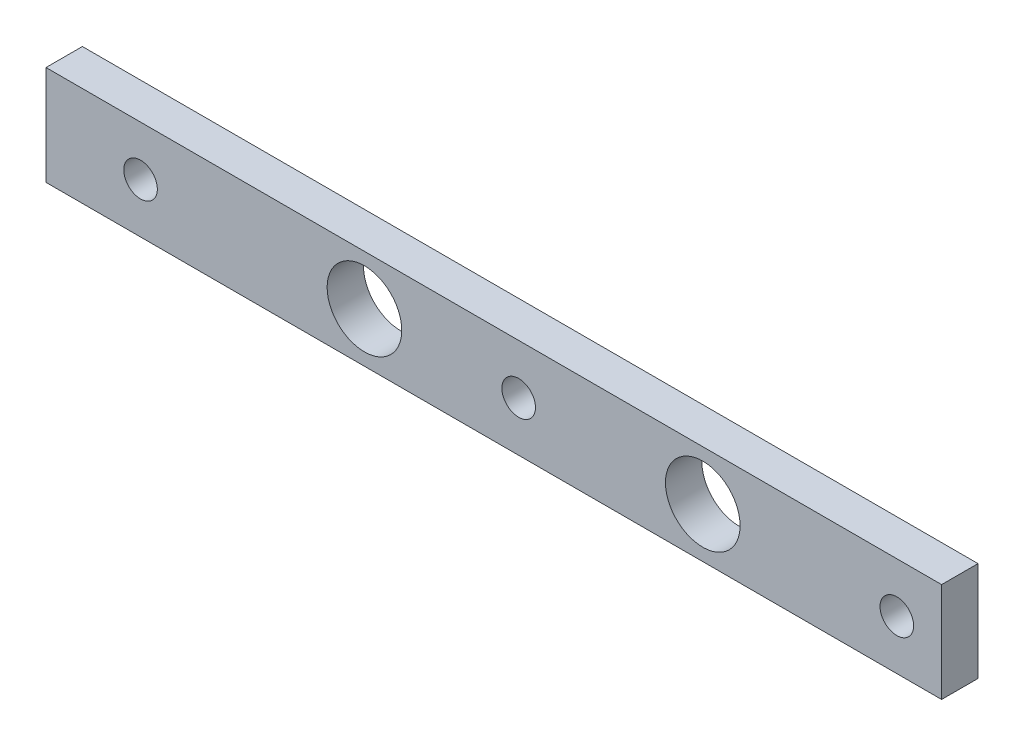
ISO-10303-21;
HEADER;
FILE_DESCRIPTION(('STEP AP214'),'2;1');
FILE_NAME('part.step','',(''),(''),'','','');
FILE_SCHEMA(('AUTOMOTIVE_DESIGN { 1 0 10303 214 1 1 1 1 }'));
ENDSEC;
DATA;
#1=APPLICATION_CONTEXT('core data for automotive mechanical design processes');
#2=APPLICATION_PROTOCOL_DEFINITION('international standard','automotive_design',2000,#1);
#3=PRODUCT_CONTEXT('',#1,'mechanical');
#4=PRODUCT('Part','Part','',(#3));
#5=PRODUCT_RELATED_PRODUCT_CATEGORY('part','',(#4));
#6=PRODUCT_DEFINITION_FORMATION('','',#4);
#7=PRODUCT_DEFINITION_CONTEXT('part definition',#1,'design');
#8=PRODUCT_DEFINITION('design','',#6,#7);
#9=PRODUCT_DEFINITION_SHAPE('','',#8);
#10=(LENGTH_UNIT() NAMED_UNIT(*) SI_UNIT(.MILLI.,.METRE.));
#11=(NAMED_UNIT(*) PLANE_ANGLE_UNIT() SI_UNIT($,.RADIAN.));
#12=(NAMED_UNIT(*) SI_UNIT($,.STERADIAN.) SOLID_ANGLE_UNIT());
#13=UNCERTAINTY_MEASURE_WITH_UNIT(LENGTH_MEASURE(1.E-05),#10,'distance_accuracy_value','');
#14=(GEOMETRIC_REPRESENTATION_CONTEXT(3) GLOBAL_UNCERTAINTY_ASSIGNED_CONTEXT((#13)) GLOBAL_UNIT_ASSIGNED_CONTEXT((#10,
#11,#12)) REPRESENTATION_CONTEXT('',''));
#15=CARTESIAN_POINT('',(0.,0.,0.));
#16=DIRECTION('',(0.,0.,1.));
#17=DIRECTION('',(1.,0.,0.));
#18=AXIS2_PLACEMENT_3D('',#15,#16,#17);
#19=CARTESIAN_POINT('',(-741.045,57.15,11.6082064));
#20=DIRECTION('',(1.,0.,0.));
#21=DIRECTION('',(0.,0.,-1.));
#22=AXIS2_PLACEMENT_3D('',#19,#20,#21);
#23=PLANE('',#22);
#24=DIRECTION('',(0.,-1.,0.));
#25=VECTOR('',#24,1.);
#26=CARTESIAN_POINT('',(-741.045,57.15,0.));
#27=LINE('',#26,#25);
#28=CARTESIAN_POINT('',(-741.045,57.15,0.));
#29=VERTEX_POINT('',#28);
#30=CARTESIAN_POINT('',(-741.045,25.4,0.));
#31=VERTEX_POINT('',#30);
#32=EDGE_CURVE('E112',#29,#31,#27,.T.);
#33=ORIENTED_EDGE('',*,*,#32,.T.);
#34=DIRECTION('',(0.,0.,-1.));
#35=VECTOR('',#34,1.);
#36=CARTESIAN_POINT('',(-741.045,25.4,11.6082064));
#37=LINE('',#36,#35);
#38=CARTESIAN_POINT('',(-741.045,25.4,11.6082064));
#39=VERTEX_POINT('',#38);
#40=EDGE_CURVE('E11',#39,#31,#37,.T.);
#41=ORIENTED_EDGE('',*,*,#40,.F.);
#42=DIRECTION('',(0.,-1.,0.));
#43=VECTOR('',#42,1.);
#44=CARTESIAN_POINT('',(-741.045,57.15,11.6082064));
#45=LINE('',#44,#43);
#46=CARTESIAN_POINT('',(-741.045,57.15,11.6082064));
#47=VERTEX_POINT('',#46);
#48=EDGE_CURVE('E98',#47,#39,#45,.T.);
#49=ORIENTED_EDGE('',*,*,#48,.F.);
#50=DIRECTION('',(0.,0.,-1.));
#51=VECTOR('',#50,1.);
#52=CARTESIAN_POINT('',(-741.045,57.15,11.6082064));
#53=LINE('',#52,#51);
#54=EDGE_CURVE('E108',#47,#29,#53,.T.);
#55=ORIENTED_EDGE('',*,*,#54,.T.);
#56=EDGE_LOOP('',(#33,#41,#49,#55));
#57=FACE_BOUND('',#56,.T.);
#58=ADVANCED_FACE('F47',(#57),#23,.F.);
#59=CARTESIAN_POINT('',(-741.045,25.4,11.6082064));
#60=DIRECTION('',(0.,1.,0.));
#61=DIRECTION('',(0.,0.,1.));
#62=AXIS2_PLACEMENT_3D('',#59,#60,#61);
#63=PLANE('',#62);
#64=DIRECTION('',(1.,0.,0.));
#65=VECTOR('',#64,1.);
#66=CARTESIAN_POINT('',(-741.045,25.4,0.));
#67=LINE('',#66,#65);
#68=CARTESIAN_POINT('',(-455.295,25.4,0.));
#69=VERTEX_POINT('',#68);
#70=EDGE_CURVE('E103',#31,#69,#67,.T.);
#71=ORIENTED_EDGE('',*,*,#70,.T.);
#72=DIRECTION('',(0.,0.,-1.));
#73=VECTOR('',#72,1.);
#74=CARTESIAN_POINT('',(-455.295,25.4,11.6082064));
#75=LINE('',#74,#73);
#76=CARTESIAN_POINT('',(-455.295,25.4,11.6082064));
#77=VERTEX_POINT('',#76);
#78=EDGE_CURVE('E55',#77,#69,#75,.T.);
#79=ORIENTED_EDGE('',*,*,#78,.F.);
#80=DIRECTION('',(1.,0.,0.));
#81=VECTOR('',#80,1.);
#82=CARTESIAN_POINT('',(-741.045,25.4,11.6082064));
#83=LINE('',#82,#81);
#84=EDGE_CURVE('E93',#39,#77,#83,.T.);
#85=ORIENTED_EDGE('',*,*,#84,.F.);
#86=ORIENTED_EDGE('',*,*,#40,.T.);
#87=EDGE_LOOP('',(#71,#79,#85,#86));
#88=FACE_BOUND('',#87,.T.);
#89=ADVANCED_FACE('F102',(#88),#63,.F.);
#90=CARTESIAN_POINT('',(-455.295,57.15,11.6082064));
#91=DIRECTION('',(-1.,0.,0.));
#92=DIRECTION('',(0.,0.,1.));
#93=AXIS2_PLACEMENT_3D('',#90,#91,#92);
#94=PLANE('',#93);
#95=DIRECTION('',(0.,1.,0.));
#96=VECTOR('',#95,1.);
#97=CARTESIAN_POINT('',(-455.295,57.15,0.));
#98=LINE('',#97,#96);
#99=CARTESIAN_POINT('',(-455.295,57.15,0.));
#100=VERTEX_POINT('',#99);
#101=EDGE_CURVE('E80',#69,#100,#98,.T.);
#102=ORIENTED_EDGE('',*,*,#101,.T.);
#103=DIRECTION('',(0.,0.,-1.));
#104=VECTOR('',#103,1.);
#105=CARTESIAN_POINT('',(-455.295,57.15,11.6082064));
#106=LINE('',#105,#104);
#107=CARTESIAN_POINT('',(-455.295,57.15,11.6082064));
#108=VERTEX_POINT('',#107);
#109=EDGE_CURVE('E104',#108,#100,#106,.T.);
#110=ORIENTED_EDGE('',*,*,#109,.F.);
#111=DIRECTION('',(0.,1.,0.));
#112=VECTOR('',#111,1.);
#113=CARTESIAN_POINT('',(-455.295,57.15,11.6082064));
#114=LINE('',#113,#112);
#115=EDGE_CURVE('E96',#77,#108,#114,.T.);
#116=ORIENTED_EDGE('',*,*,#115,.F.);
#117=ORIENTED_EDGE('',*,*,#78,.T.);
#118=EDGE_LOOP('',(#102,#110,#116,#117));
#119=FACE_BOUND('',#118,.T.);
#120=ADVANCED_FACE('F105',(#119),#94,.F.);
#121=CARTESIAN_POINT('',(-741.045,57.15,11.6082064));
#122=DIRECTION('',(0.,-1.,0.));
#123=DIRECTION('',(0.,0.,-1.));
#124=AXIS2_PLACEMENT_3D('',#121,#122,#123);
#125=PLANE('',#124);
#126=DIRECTION('',(-1.,0.,0.));
#127=VECTOR('',#126,1.);
#128=CARTESIAN_POINT('',(-741.045,57.15,0.));
#129=LINE('',#128,#127);
#130=EDGE_CURVE('E86',#100,#29,#129,.T.);
#131=ORIENTED_EDGE('',*,*,#130,.T.);
#132=ORIENTED_EDGE('',*,*,#54,.F.);
#133=DIRECTION('',(-1.,0.,0.));
#134=VECTOR('',#133,1.);
#135=CARTESIAN_POINT('',(-741.045,57.15,11.6082064));
#136=LINE('',#135,#134);
#137=EDGE_CURVE('E63',#108,#47,#136,.T.);
#138=ORIENTED_EDGE('',*,*,#137,.F.);
#139=ORIENTED_EDGE('',*,*,#109,.T.);
#140=EDGE_LOOP('',(#131,#132,#138,#139));
#141=FACE_BOUND('',#140,.T.);
#142=ADVANCED_FACE('F122',(#141),#125,.F.);
#143=CARTESIAN_POINT('',(0.,0.,11.6082064));
#144=DIRECTION('',(0.,0.,1.));
#145=DIRECTION('',(1.,0.,0.));
#146=AXIS2_PLACEMENT_3D('',#143,#144,#145);
#147=PLANE('',#146);
#148=CARTESIAN_POINT('',(-639.445,41.275,11.6082064));
#149=DIRECTION('',(0.,0.,-1.));
#150=DIRECTION('',(-1.,0.,0.));
#151=AXIS2_PLACEMENT_3D('',#148,#149,#150);
#152=CIRCLE('',#151,11.90625);
#153=CARTESIAN_POINT('',(-651.35125,41.275,11.6082064));
#154=VERTEX_POINT('',#153);
#155=EDGE_CURVE('E175',#154,#154,#152,.T.);
#156=ORIENTED_EDGE('',*,*,#155,.T.);
#157=EDGE_LOOP('',(#156));
#158=FACE_BOUND('',#157,.T.);
#159=CARTESIAN_POINT('',(-531.495,41.275,11.6082064));
#160=DIRECTION('',(0.,0.,-1.));
#161=DIRECTION('',(-1.,0.,0.));
#162=AXIS2_PLACEMENT_3D('',#159,#160,#161);
#163=CIRCLE('',#162,11.90625);
#164=CARTESIAN_POINT('',(-543.40125,41.275,11.6082064));
#165=VERTEX_POINT('',#164);
#166=EDGE_CURVE('E167',#165,#165,#163,.T.);
#167=ORIENTED_EDGE('',*,*,#166,.T.);
#168=EDGE_LOOP('',(#167));
#169=FACE_BOUND('',#168,.T.);
#170=CARTESIAN_POINT('',(-710.8825,41.275,11.6082064));
#171=DIRECTION('',(0.,0.,1.));
#172=DIRECTION('',(1.,0.,0.));
#173=AXIS2_PLACEMENT_3D('',#170,#171,#172);
#174=CIRCLE('',#173,5.35940000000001);
#175=CARTESIAN_POINT('',(-705.5231,41.275,11.6082064));
#176=VERTEX_POINT('',#175);
#177=EDGE_CURVE('E151',#176,#176,#174,.T.);
#178=ORIENTED_EDGE('',*,*,#177,.F.);
#179=EDGE_LOOP('',(#178));
#180=FACE_BOUND('',#179,.T.);
#181=CARTESIAN_POINT('',(-469.5825,41.275,11.6082064));
#182=DIRECTION('',(0.,0.,1.));
#183=DIRECTION('',(1.,0.,0.));
#184=AXIS2_PLACEMENT_3D('',#181,#182,#183);
#185=CIRCLE('',#184,5.35940000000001);
#186=CARTESIAN_POINT('',(-464.2231,41.275,11.6082064));
#187=VERTEX_POINT('',#186);
#188=EDGE_CURVE('E139',#187,#187,#185,.T.);
#189=ORIENTED_EDGE('',*,*,#188,.F.);
#190=EDGE_LOOP('',(#189));
#191=FACE_BOUND('',#190,.T.);
#192=CARTESIAN_POINT('',(-590.2325,41.275,11.6082064));
#193=DIRECTION('',(0.,0.,1.));
#194=DIRECTION('',(1.,0.,0.));
#195=AXIS2_PLACEMENT_3D('',#192,#193,#194);
#196=CIRCLE('',#195,5.35940000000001);
#197=CARTESIAN_POINT('',(-584.8731,41.275,11.6082064));
#198=VERTEX_POINT('',#197);
#199=EDGE_CURVE('E115',#198,#198,#196,.T.);
#200=ORIENTED_EDGE('',*,*,#199,.F.);
#201=EDGE_LOOP('',(#200));
#202=FACE_BOUND('',#201,.T.);
#203=ORIENTED_EDGE('',*,*,#48,.T.);
#204=ORIENTED_EDGE('',*,*,#84,.T.);
#205=ORIENTED_EDGE('',*,*,#115,.T.);
#206=ORIENTED_EDGE('',*,*,#137,.T.);
#207=EDGE_LOOP('',(#203,#204,#205,#206));
#208=FACE_BOUND('',#207,.T.);
#209=ADVANCED_FACE('F94',(#158,#169,#180,#191,#202,#208),#147,.T.);
#210=CARTESIAN_POINT('',(0.,0.,0.));
#211=DIRECTION('',(0.,0.,1.));
#212=DIRECTION('',(1.,0.,0.));
#213=AXIS2_PLACEMENT_3D('',#210,#211,#212);
#214=PLANE('',#213);
#215=CARTESIAN_POINT('',(-639.445,41.275,0.));
#216=DIRECTION('',(0.,0.,-1.));
#217=DIRECTION('',(-1.,0.,0.));
#218=AXIS2_PLACEMENT_3D('',#215,#216,#217);
#219=CIRCLE('',#218,11.90625);
#220=CARTESIAN_POINT('',(-651.35125,41.275,0.));
#221=VERTEX_POINT('',#220);
#222=EDGE_CURVE('E171',#221,#221,#219,.T.);
#223=ORIENTED_EDGE('',*,*,#222,.F.);
#224=EDGE_LOOP('',(#223));
#225=FACE_BOUND('',#224,.T.);
#226=CARTESIAN_POINT('',(-531.495,41.275,0.));
#227=DIRECTION('',(0.,0.,-1.));
#228=DIRECTION('',(-1.,0.,0.));
#229=AXIS2_PLACEMENT_3D('',#226,#227,#228);
#230=CIRCLE('',#229,11.90625);
#231=CARTESIAN_POINT('',(-543.40125,41.275,0.));
#232=VERTEX_POINT('',#231);
#233=EDGE_CURVE('E163',#232,#232,#230,.T.);
#234=ORIENTED_EDGE('',*,*,#233,.F.);
#235=EDGE_LOOP('',(#234));
#236=FACE_BOUND('',#235,.T.);
#237=CARTESIAN_POINT('',(-710.8825,41.275,0.));
#238=DIRECTION('',(0.,0.,1.));
#239=DIRECTION('',(1.,0.,0.));
#240=AXIS2_PLACEMENT_3D('',#237,#238,#239);
#241=CIRCLE('',#240,3.56869999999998);
#242=CARTESIAN_POINT('',(-707.3138,41.275,0.));
#243=VERTEX_POINT('',#242);
#244=EDGE_CURVE('E160',#243,#243,#241,.T.);
#245=ORIENTED_EDGE('',*,*,#244,.T.);
#246=EDGE_LOOP('',(#245));
#247=FACE_BOUND('',#246,.T.);
#248=CARTESIAN_POINT('',(-469.5825,41.275,0.));
#249=DIRECTION('',(0.,0.,1.));
#250=DIRECTION('',(1.,0.,0.));
#251=AXIS2_PLACEMENT_3D('',#248,#249,#250);
#252=CIRCLE('',#251,3.56869999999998);
#253=CARTESIAN_POINT('',(-466.0138,41.275,0.));
#254=VERTEX_POINT('',#253);
#255=EDGE_CURVE('E148',#254,#254,#252,.T.);
#256=ORIENTED_EDGE('',*,*,#255,.T.);
#257=EDGE_LOOP('',(#256));
#258=FACE_BOUND('',#257,.T.);
#259=CARTESIAN_POINT('',(-590.2325,41.275,0.));
#260=DIRECTION('',(0.,0.,1.));
#261=DIRECTION('',(1.,0.,0.));
#262=AXIS2_PLACEMENT_3D('',#259,#260,#261);
#263=CIRCLE('',#262,3.56869999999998);
#264=CARTESIAN_POINT('',(-586.6638,41.275,0.));
#265=VERTEX_POINT('',#264);
#266=EDGE_CURVE('E136',#265,#265,#263,.T.);
#267=ORIENTED_EDGE('',*,*,#266,.T.);
#268=EDGE_LOOP('',(#267));
#269=FACE_BOUND('',#268,.T.);
#270=ORIENTED_EDGE('',*,*,#32,.F.);
#271=ORIENTED_EDGE('',*,*,#130,.F.);
#272=ORIENTED_EDGE('',*,*,#101,.F.);
#273=ORIENTED_EDGE('',*,*,#70,.F.);
#274=EDGE_LOOP('',(#270,#271,#272,#273));
#275=FACE_BOUND('',#274,.T.);
#276=ADVANCED_FACE('F125',(#225,#236,#247,#258,#269,#275),#214,.F.);
#277=CARTESIAN_POINT('',(-590.2325,41.275,11.6082064));
#278=DIRECTION('',(0.,0.,1.));
#279=DIRECTION('',(1.,0.,0.));
#280=AXIS2_PLACEMENT_3D('',#277,#278,#279);
#281=CYLINDRICAL_SURFACE('',#280,5.35940000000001);
#282=CARTESIAN_POINT('',(-590.2325,41.275,3.7342064));
#283=DIRECTION('',(0.,0.,1.));
#284=DIRECTION('',(1.,0.,0.));
#285=AXIS2_PLACEMENT_3D('',#282,#283,#284);
#286=CIRCLE('',#285,5.35940000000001);
#287=CARTESIAN_POINT('',(-584.8731,41.275,3.7342064));
#288=VERTEX_POINT('',#287);
#289=EDGE_CURVE('E130',#288,#288,#286,.T.);
#290=ORIENTED_EDGE('',*,*,#289,.F.);
#291=EDGE_LOOP('',(#290));
#292=FACE_BOUND('',#291,.T.);
#293=ORIENTED_EDGE('',*,*,#199,.T.);
#294=EDGE_LOOP('',(#293));
#295=FACE_BOUND('',#294,.T.);
#296=ADVANCED_FACE('F191',(#292,#295),#281,.F.);
#297=CARTESIAN_POINT('',(-586.6638,41.275,3.7342064));
#298=DIRECTION('',(0.,0.,-1.));
#299=DIRECTION('',(-1.,0.,0.));
#300=AXIS2_PLACEMENT_3D('',#297,#298,#299);
#301=PLANE('',#300);
#302=CARTESIAN_POINT('',(-590.2325,41.275,3.7342064));
#303=DIRECTION('',(0.,0.,1.));
#304=DIRECTION('',(1.,0.,0.));
#305=AXIS2_PLACEMENT_3D('',#302,#303,#304);
#306=CIRCLE('',#305,3.56869999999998);
#307=CARTESIAN_POINT('',(-586.6638,41.275,3.7342064));
#308=VERTEX_POINT('',#307);
#309=EDGE_CURVE('E133',#308,#308,#306,.T.);
#310=ORIENTED_EDGE('',*,*,#309,.F.);
#311=EDGE_LOOP('',(#310));
#312=FACE_BOUND('',#311,.T.);
#313=ORIENTED_EDGE('',*,*,#289,.T.);
#314=EDGE_LOOP('',(#313));
#315=FACE_BOUND('',#314,.T.);
#316=ADVANCED_FACE('F205',(#312,#315),#301,.F.);
#317=CARTESIAN_POINT('',(-590.2325,41.275,11.6082064));
#318=DIRECTION('',(0.,0.,1.));
#319=DIRECTION('',(1.,0.,0.));
#320=AXIS2_PLACEMENT_3D('',#317,#318,#319);
#321=CYLINDRICAL_SURFACE('',#320,3.56869999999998);
#322=ORIENTED_EDGE('',*,*,#266,.F.);
#323=EDGE_LOOP('',(#322));
#324=FACE_BOUND('',#323,.T.);
#325=ORIENTED_EDGE('',*,*,#309,.T.);
#326=EDGE_LOOP('',(#325));
#327=FACE_BOUND('',#326,.T.);
#328=ADVANCED_FACE('F201',(#324,#327),#321,.F.);
#329=CARTESIAN_POINT('',(-469.5825,41.275,11.6082064));
#330=DIRECTION('',(0.,0.,1.));
#331=DIRECTION('',(1.,0.,0.));
#332=AXIS2_PLACEMENT_3D('',#329,#330,#331);
#333=CYLINDRICAL_SURFACE('',#332,5.35940000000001);
#334=CARTESIAN_POINT('',(-469.5825,41.275,3.7342064));
#335=DIRECTION('',(0.,0.,1.));
#336=DIRECTION('',(1.,0.,0.));
#337=AXIS2_PLACEMENT_3D('',#334,#335,#336);
#338=CIRCLE('',#337,5.35940000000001);
#339=CARTESIAN_POINT('',(-464.2231,41.275,3.7342064));
#340=VERTEX_POINT('',#339);
#341=EDGE_CURVE('E142',#340,#340,#338,.T.);
#342=ORIENTED_EDGE('',*,*,#341,.F.);
#343=EDGE_LOOP('',(#342));
#344=FACE_BOUND('',#343,.T.);
#345=ORIENTED_EDGE('',*,*,#188,.T.);
#346=EDGE_LOOP('',(#345));
#347=FACE_BOUND('',#346,.T.);
#348=ADVANCED_FACE('F204',(#344,#347),#333,.F.);
#349=CARTESIAN_POINT('',(-466.0138,41.275,3.7342064));
#350=DIRECTION('',(0.,0.,-1.));
#351=DIRECTION('',(-1.,0.,0.));
#352=AXIS2_PLACEMENT_3D('',#349,#350,#351);
#353=PLANE('',#352);
#354=CARTESIAN_POINT('',(-469.5825,41.275,3.7342064));
#355=DIRECTION('',(0.,0.,1.));
#356=DIRECTION('',(1.,0.,0.));
#357=AXIS2_PLACEMENT_3D('',#354,#355,#356);
#358=CIRCLE('',#357,3.56869999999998);
#359=CARTESIAN_POINT('',(-466.0138,41.275,3.7342064));
#360=VERTEX_POINT('',#359);
#361=EDGE_CURVE('E145',#360,#360,#358,.T.);
#362=ORIENTED_EDGE('',*,*,#361,.F.);
#363=EDGE_LOOP('',(#362));
#364=FACE_BOUND('',#363,.T.);
#365=ORIENTED_EDGE('',*,*,#341,.T.);
#366=EDGE_LOOP('',(#365));
#367=FACE_BOUND('',#366,.T.);
#368=ADVANCED_FACE('F274',(#364,#367),#353,.F.);
#369=CARTESIAN_POINT('',(-469.5825,41.275,11.6082064));
#370=DIRECTION('',(0.,0.,1.));
#371=DIRECTION('',(1.,0.,0.));
#372=AXIS2_PLACEMENT_3D('',#369,#370,#371);
#373=CYLINDRICAL_SURFACE('',#372,3.56869999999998);
#374=ORIENTED_EDGE('',*,*,#255,.F.);
#375=EDGE_LOOP('',(#374));
#376=FACE_BOUND('',#375,.T.);
#377=ORIENTED_EDGE('',*,*,#361,.T.);
#378=EDGE_LOOP('',(#377));
#379=FACE_BOUND('',#378,.T.);
#380=ADVANCED_FACE('F285',(#376,#379),#373,.F.);
#381=CARTESIAN_POINT('',(-710.8825,41.275,11.6082064));
#382=DIRECTION('',(0.,0.,1.));
#383=DIRECTION('',(1.,0.,0.));
#384=AXIS2_PLACEMENT_3D('',#381,#382,#383);
#385=CYLINDRICAL_SURFACE('',#384,5.35940000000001);
#386=CARTESIAN_POINT('',(-710.8825,41.275,3.7342064));
#387=DIRECTION('',(0.,0.,1.));
#388=DIRECTION('',(1.,0.,0.));
#389=AXIS2_PLACEMENT_3D('',#386,#387,#388);
#390=CIRCLE('',#389,5.35940000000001);
#391=CARTESIAN_POINT('',(-705.5231,41.275,3.7342064));
#392=VERTEX_POINT('',#391);
#393=EDGE_CURVE('E154',#392,#392,#390,.T.);
#394=ORIENTED_EDGE('',*,*,#393,.F.);
#395=EDGE_LOOP('',(#394));
#396=FACE_BOUND('',#395,.T.);
#397=ORIENTED_EDGE('',*,*,#177,.T.);
#398=EDGE_LOOP('',(#397));
#399=FACE_BOUND('',#398,.T.);
#400=ADVANCED_FACE('F295',(#396,#399),#385,.F.);
#401=CARTESIAN_POINT('',(-707.3138,41.275,3.7342064));
#402=DIRECTION('',(0.,0.,-1.));
#403=DIRECTION('',(-1.,0.,0.));
#404=AXIS2_PLACEMENT_3D('',#401,#402,#403);
#405=PLANE('',#404);
#406=CARTESIAN_POINT('',(-710.8825,41.275,3.7342064));
#407=DIRECTION('',(0.,0.,1.));
#408=DIRECTION('',(1.,0.,0.));
#409=AXIS2_PLACEMENT_3D('',#406,#407,#408);
#410=CIRCLE('',#409,3.56869999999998);
#411=CARTESIAN_POINT('',(-707.3138,41.275,3.7342064));
#412=VERTEX_POINT('',#411);
#413=EDGE_CURVE('E157',#412,#412,#410,.T.);
#414=ORIENTED_EDGE('',*,*,#413,.F.);
#415=EDGE_LOOP('',(#414));
#416=FACE_BOUND('',#415,.T.);
#417=ORIENTED_EDGE('',*,*,#393,.T.);
#418=EDGE_LOOP('',(#417));
#419=FACE_BOUND('',#418,.T.);
#420=ADVANCED_FACE('F307',(#416,#419),#405,.F.);
#421=CARTESIAN_POINT('',(-710.8825,41.275,11.6082064));
#422=DIRECTION('',(0.,0.,1.));
#423=DIRECTION('',(1.,0.,0.));
#424=AXIS2_PLACEMENT_3D('',#421,#422,#423);
#425=CYLINDRICAL_SURFACE('',#424,3.56869999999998);
#426=ORIENTED_EDGE('',*,*,#244,.F.);
#427=EDGE_LOOP('',(#426));
#428=FACE_BOUND('',#427,.T.);
#429=ORIENTED_EDGE('',*,*,#413,.T.);
#430=EDGE_LOOP('',(#429));
#431=FACE_BOUND('',#430,.T.);
#432=ADVANCED_FACE('F317',(#428,#431),#425,.F.);
#433=CARTESIAN_POINT('',(-531.495,41.275,0.));
#434=DIRECTION('',(0.,0.,-1.));
#435=DIRECTION('',(-1.,0.,0.));
#436=AXIS2_PLACEMENT_3D('',#433,#434,#435);
#437=CYLINDRICAL_SURFACE('',#436,11.90625);
#438=ORIENTED_EDGE('',*,*,#166,.F.);
#439=EDGE_LOOP('',(#438));
#440=FACE_BOUND('',#439,.T.);
#441=ORIENTED_EDGE('',*,*,#233,.T.);
#442=EDGE_LOOP('',(#441));
#443=FACE_BOUND('',#442,.T.);
#444=ADVANCED_FACE('F185',(#440,#443),#437,.F.);
#445=CARTESIAN_POINT('',(-639.445,41.275,0.));
#446=DIRECTION('',(0.,0.,-1.));
#447=DIRECTION('',(-1.,0.,0.));
#448=AXIS2_PLACEMENT_3D('',#445,#446,#447);
#449=CYLINDRICAL_SURFACE('',#448,11.90625);
#450=ORIENTED_EDGE('',*,*,#155,.F.);
#451=EDGE_LOOP('',(#450));
#452=FACE_BOUND('',#451,.T.);
#453=ORIENTED_EDGE('',*,*,#222,.T.);
#454=EDGE_LOOP('',(#453));
#455=FACE_BOUND('',#454,.T.);
#456=ADVANCED_FACE('F182',(#452,#455),#449,.F.);
#457=CLOSED_SHELL('',(#58,#89,#120,#142,#209,#276,#296,#316,#328,#348,#368,#380,#400,#420,#432,
#444,#456));
#458=MANIFOLD_SOLID_BREP('B2',#457);
#459=ADVANCED_BREP_SHAPE_REPRESENTATION('',(#18,#458),#14);
#460=SHAPE_DEFINITION_REPRESENTATION(#9,#459);
ENDSEC;
END-ISO-10303-21;
